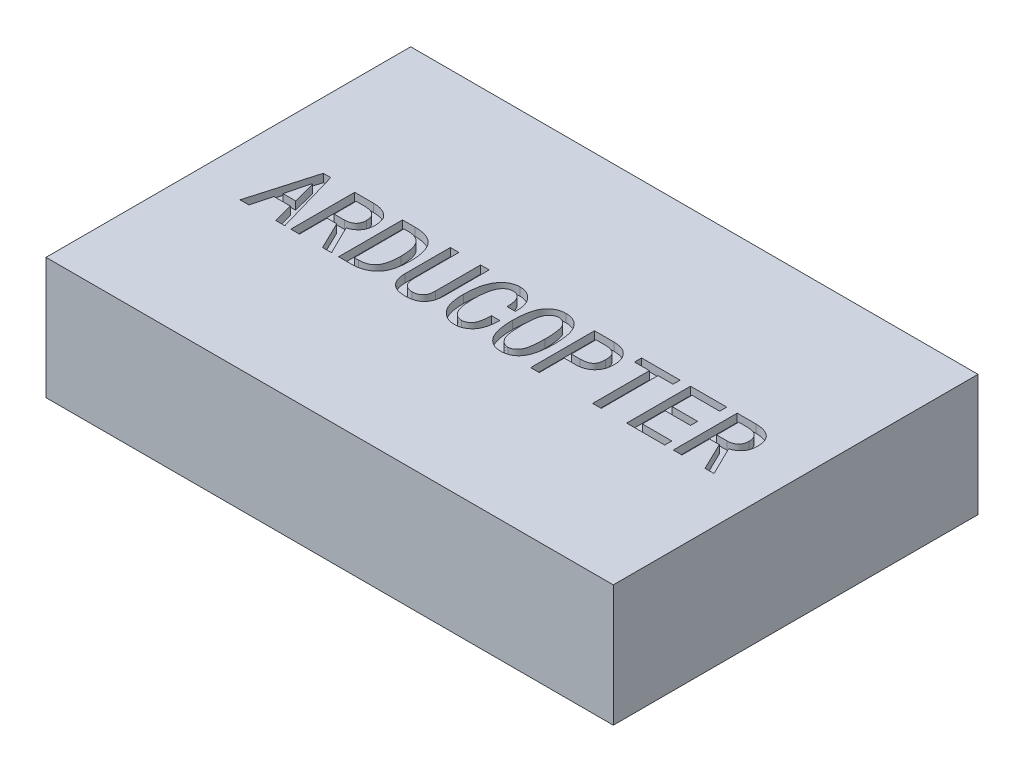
from build123d import *

# Parameters (mm, degrees)
SKETCH_1_W          = 70
SKETCH_1_H          = 45
EXTRUDE_1_DEPTH     = 15
CUT_EXTRUDE_1_DEPTH = 1


with BuildPart() as part:
    # Sketch 1 → Extrude 1 (new body)
    with BuildSketch(Plane(origin=(0, 0, 0), x_dir=(1, 0, 0), z_dir=(0, 1, 0))):
        Rectangle(SKETCH_1_W, SKETCH_1_H)
    extrude(amount=EXTRUDE_1_DEPTH)

    # Sketch 2 → Cut-Extrude 1 (cut)
    # profile 1 of 10: a face of its own
    with BuildSketch(Plane(origin=(0, 15, 0), x_dir=(1, 0, 0), z_dir=(0, 1, 0))):
        Polygon((-23.644846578, -4.387578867), (-24.751145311, -4.387578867), (-25.396486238, -1.944502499), (-27.424700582, -1.944502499), (-28.07004151, -4.387578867), (-29.176340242, -4.387578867), (-26.871551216, 3.586991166), (-25.949635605, 3.586991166), align=None)
        Polygon((-25.626965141, -1.068682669), (-26.36449763, 1.743159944), (-26.456689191, 1.743159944), (-27.194221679, -1.068682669), align=None, mode=Mode.SUBTRACT)
    # profile 2 of 10: a face of its own
    with BuildSketch(Plane(origin=(0, 15, 0), x_dir=(1, 0, 0), z_dir=(0, 1, 0))):
        with BuildLine():
            Line((-17.88287401, -4.387578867), (-18.989172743, -4.387578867))
            Line((-18.989172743, -4.387578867), (-20.648620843, -0.976491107))
            Line((-20.648620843, -0.976491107), (-21.847111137, -0.976491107))
            Line((-21.847111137, -0.976491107), (-21.847111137, -4.387578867))
            Line((-21.847111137, -4.387578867), (-22.907314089, -4.387578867))
            Line((-22.907314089, -4.387578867), (-22.907314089, 3.494799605))
            Line((-22.907314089, 3.494799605), (-20.602525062, 3.494799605))
            add(Edge.make_bspline(
                [(-20.602525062, 3.494799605), (-20.512567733, 3.493015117), (-20.336313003, 3.489518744), (-20.078159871, 3.466438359), (-19.833532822, 3.423223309), (-19.601934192, 3.364943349), (-19.382117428, 3.292886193), (-19.176814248, 3.199105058), (-18.982860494, 3.092073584), (-18.802713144, 2.967533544), (-18.639657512, 2.824467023), (-18.496904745, 2.6595892), (-18.378204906, 2.472695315), (-18.279465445, 2.265345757), (-18.205861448, 2.037102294), (-18.150603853, 1.788626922), (-18.118524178, 1.519214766), (-18.115111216, 1.332367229), (-18.113352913, 1.236106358)],
                knots=[0, 0, 0, 0, 1.124851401, 2.203938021, 3.236923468, 4.227547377, 5.188384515, 6.124748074, 7.04535131, 7.955333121, 8.85768773, 9.750678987, 10.67246398, 11.61778816, 12.61462837, 13.664292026, 14.796680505, 16, 16, 16, 16], degree=3))
            add(Edge.make_bspline(
                [(-18.113352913, 1.236106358), (-18.11443924, 1.161494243), (-18.116559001, 1.015902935), (-18.139515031, 0.8042374), (-18.17480282, 0.605508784), (-18.224171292, 0.419561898), (-18.288588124, 0.246426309), (-18.369887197, 0.08683872), (-18.463299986, -0.060922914), (-18.606568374, -0.236004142), (-18.804447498, -0.425502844), (-19.062793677, -0.613071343), (-19.339787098, -0.755222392), (-19.536611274, -0.810638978), (-19.634513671, -0.838203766)],
                knots=[0, 0, 0, 0, 0.960252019, 1.873748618, 2.737466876, 3.556786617, 4.347431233, 5.110891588, 5.858830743, 6.593445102, 8.018399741, 9.372640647, 10.693124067, 12, 12, 12, 12], degree=3))
            Line((-19.634513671, -0.838203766), (-17.88287401, -4.387578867))
        make_face()
        with BuildLine():
            add(Edge.make_bspline(
                [(-19.173555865, 1.236106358), (-19.175135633, 1.288493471), (-19.178217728, 1.390699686), (-19.194410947, 1.540139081), (-19.225867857, 1.680517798), (-19.267247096, 1.812981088), (-19.325765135, 1.934613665), (-19.390722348, 2.050445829), (-19.473265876, 2.154731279), (-19.564833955, 2.253107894), (-19.671507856, 2.340424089), (-19.792752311, 2.4167878), (-19.929786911, 2.479052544), (-20.081569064, 2.530046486), (-20.247643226, 2.571146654), (-20.429279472, 2.599461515), (-20.626088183, 2.616703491), (-20.762399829, 2.618203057), (-20.833003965, 2.618979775)],
                knots=[0, 0, 0, 0, 1.018423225, 1.986923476, 2.915383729, 3.810714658, 4.676600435, 5.533969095, 6.385612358, 7.253966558, 8.141821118, 9.056210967, 10.031005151, 11.059229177, 12.164336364, 13.351610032, 14.628236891, 16, 16, 16, 16], degree=3))
            Line((-20.833003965, 2.618979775), (-21.847111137, 2.618979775))
            Line((-21.847111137, 2.618979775), (-21.847111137, -0.100671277))
            Line((-21.847111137, -0.100671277), (-20.556429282, -0.100671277))
            add(Edge.make_bspline(
                [(-20.556429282, -0.100671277), (-20.466764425, -0.097274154), (-20.291266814, -0.090625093), (-20.037806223, -0.032287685), (-19.801148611, 0.060932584), (-19.619821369, 0.169578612), (-19.488610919, 0.277379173), (-19.404513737, 0.374987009), (-19.33195032, 0.484807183), (-19.274362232, 0.609484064), (-19.227913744, 0.746706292), (-19.196043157, 0.89797495), (-19.17756749, 1.062643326), (-19.174925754, 1.176872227), (-19.173555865, 1.236106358)],
                knots=[0, 0, 0, 0, 1.47184772, 2.880791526, 4.249240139, 5.638178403, 6.335067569, 7.030952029, 7.746845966, 8.491482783, 9.28109559, 10.123026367, 11.02668324, 12, 12, 12, 12], degree=3))
        make_face(mode=Mode.SUBTRACT)
    # profile 3 of 10: a face of its own
    with BuildSketch(Plane(origin=(0, 15, 0), x_dir=(1, 0, 0), z_dir=(0, 1, 0))):
        with BuildLine():
            add(Edge.make_bspline(
                [(-12.120901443, -0.469437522), (-12.123137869, -0.639698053), (-12.127453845, -0.968276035), (-12.171159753, -1.442181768), (-12.238847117, -1.878701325), (-12.337780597, -2.276974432), (-12.463493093, -2.637688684), (-12.616357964, -2.961477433), (-12.800012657, -3.246879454), (-13.013868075, -3.492182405), (-13.250730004, -3.703717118), (-13.506306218, -3.886856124), (-13.780141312, -4.043912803), (-14.075607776, -4.167845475), (-14.388408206, -4.26788342), (-14.722059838, -4.336568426), (-15.074395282, -4.380700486), (-15.316168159, -4.38525165), (-15.439797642, -4.387578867)],
                knots=[0, 0, 0, 0, 1.389524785, 2.681580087, 3.881416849, 4.992360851, 6.026729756, 6.995017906, 7.908603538, 8.787894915, 9.643211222, 10.495393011, 11.350494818, 12.214247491, 13.106065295, 14.027214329, 14.991224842, 16, 16, 16, 16], degree=3))
            Line((-15.439797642, -4.387578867), (-17.00705418, -4.387578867))
            Line((-17.00705418, -4.387578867), (-17.00705418, 3.494799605))
            Line((-17.00705418, 3.494799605), (-15.439797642, 3.494799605))
            add(Edge.make_bspline(
                [(-15.439797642, 3.494799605), (-15.301937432, 3.492703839), (-15.035118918, 3.488647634), (-14.649801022, 3.442643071), (-14.292232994, 3.372498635), (-13.962485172, 3.271736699), (-13.659878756, 3.142577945), (-13.38647735, 2.982170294), (-13.138987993, 2.795719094), (-12.921754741, 2.575239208), (-12.729686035, 2.322846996), (-12.565675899, 2.033033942), (-12.428740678, 1.706364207), (-12.313354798, 1.343904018), (-12.228685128, 0.942719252), (-12.166658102, 0.505252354), (-12.126087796, 0.030406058), (-12.122673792, -0.298624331), (-12.120901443, -0.469437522)],
                knots=[0, 0, 0, 0, 1.107739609, 2.143950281, 3.114742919, 4.033667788, 4.910720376, 5.753428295, 6.576026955, 7.394480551, 8.23354201, 9.118765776, 10.063698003, 11.076506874, 12.172173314, 13.355526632, 14.627145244, 16, 16, 16, 16], degree=3))
        make_face()
        with BuildLine():
            add(Edge.make_bspline(
                [(-13.227200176, -0.469437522), (-13.228777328, -0.332823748), (-13.231816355, -0.06958158), (-13.256614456, 0.310154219), (-13.301376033, 0.658226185), (-13.358819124, 0.975595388), (-13.437860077, 1.259639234), (-13.530388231, 1.513549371), (-13.643252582, 1.735492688), (-13.773950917, 1.927961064), (-13.923238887, 2.092253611), (-14.088970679, 2.234068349), (-14.272271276, 2.353406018), (-14.472620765, 2.452248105), (-14.690526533, 2.526080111), (-14.924758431, 2.58132598), (-15.176533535, 2.613844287), (-15.350355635, 2.617235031), (-15.439797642, 2.618979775)],
                knots=[0, 0, 0, 0, 1.50261862, 2.895407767, 4.182685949, 5.361245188, 6.439488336, 7.421939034, 8.328969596, 9.171036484, 9.973163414, 10.763455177, 11.563821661, 12.37285522, 13.214177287, 14.088724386, 15.01653284, 16, 16, 16, 16], degree=3))
            Line((-15.439797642, 2.618979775), (-15.946851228, 2.618979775))
            Line((-15.946851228, 2.618979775), (-15.946851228, -3.511759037))
            Line((-15.946851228, -3.511759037), (-15.439797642, -3.511759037))
            add(Edge.make_bspline(
                [(-15.439797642, -3.511759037), (-15.350371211, -3.509854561), (-15.176650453, -3.506154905), (-14.924860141, -3.475856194), (-14.690577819, -3.422331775), (-14.473090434, -3.349917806), (-14.272880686, -3.254683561), (-14.089187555, -3.140695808), (-13.923324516, -3.004033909), (-13.774650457, -2.845004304), (-13.642217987, -2.658710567), (-13.530581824, -2.440438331), (-13.437448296, -2.189595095), (-13.359102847, -1.908155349), (-13.301302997, -1.593724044), (-13.256422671, -1.247911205), (-13.231849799, -0.869290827), (-13.228788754, -0.606050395), (-13.227200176, -0.469437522)],
                knots=[0, 0, 0, 0, 0.9908866, 1.924907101, 2.80462885, 3.650254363, 4.45990781, 5.256111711, 6.040209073, 6.834462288, 7.662189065, 8.564851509, 9.54291023, 10.623211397, 11.798270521, 13.082748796, 14.486045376, 16, 16, 16, 16], degree=3))
        make_face(mode=Mode.SUBTRACT)
    # profile 4 of 10: a face of its own
    with BuildSketch(Plane(origin=(0, 15, 0), x_dir=(1, 0, 0), z_dir=(0, 1, 0))):
        with BuildLine():
            add(Edge.make_bspline(
                [(-6.312833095, -2.08278984), (-6.314269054, -2.172772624), (-6.31706628, -2.34805773), (-6.344693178, -2.603934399), (-6.39129586, -2.844470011), (-6.451698, -3.072701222), (-6.533741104, -3.285199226), (-6.633271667, -3.48401145), (-6.752001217, -3.667135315), (-6.886763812, -3.837031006), (-7.040369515, -3.991354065), (-7.219167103, -4.120841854), (-7.416389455, -4.232909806), (-7.635376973, -4.322517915), (-7.873946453, -4.395472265), (-8.134702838, -4.442589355), (-8.415370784, -4.474598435), (-8.609556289, -4.478009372), (-8.709813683, -4.479770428)],
                knots=[0, 0, 0, 0, 1.114057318, 2.17016686, 3.181914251, 4.146156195, 5.0898066, 5.997508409, 6.894781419, 7.787392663, 8.679419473, 9.581522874, 10.512482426, 11.482322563, 12.505662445, 13.596199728, 14.758925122, 16, 16, 16, 16], degree=3))
            add(Edge.make_bspline(
                [(-8.709813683, -4.479770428), (-8.810071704, -4.478011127), (-9.004258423, -4.474603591), (-9.28491788, -4.442570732), (-9.545703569, -4.39553573), (-9.784676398, -4.322146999), (-10.004474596, -4.233244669), (-10.202069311, -4.121429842), (-10.379422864, -3.990216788), (-10.534542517, -3.83764291), (-10.669510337, -3.667567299), (-10.786031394, -3.483469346), (-10.886184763, -3.285317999), (-10.967236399, -3.072354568), (-11.031172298, -2.845002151), (-11.074140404, -2.603661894), (-11.102779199, -2.348103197), (-11.105432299, -2.172788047), (-11.106794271, -2.08278984)],
                knots=[0, 0, 0, 0, 1.240869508, 2.403402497, 3.49375932, 4.516929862, 5.493116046, 6.423921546, 7.320215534, 8.217118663, 9.1095822, 10.00290763, 10.910459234, 11.853953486, 12.819913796, 13.830192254, 14.886127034, 16, 16, 16, 16], degree=3))
            Line((-11.106794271, -2.08278984), (-11.106794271, 3.494799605))
            Line((-11.106794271, 3.494799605), (-10.046591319, 3.494799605))
            Line((-10.046591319, 3.494799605), (-10.046591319, -2.08278984))
            add(Edge.make_bspline(
                [(-10.046591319, -2.08278984), (-10.046099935, -2.146035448), (-10.045150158, -2.268280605), (-10.023962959, -2.444699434), (-9.999484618, -2.609364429), (-9.956754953, -2.760110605), (-9.90746614, -2.899915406), (-9.841124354, -3.02395548), (-9.768005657, -3.138019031), (-9.679830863, -3.235999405), (-9.584872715, -3.323813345), (-9.479897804, -3.397365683), (-9.370230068, -3.46328131), (-9.250681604, -3.513449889), (-9.126191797, -3.556071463), (-8.993317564, -3.581118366), (-8.854464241, -3.602394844), (-8.758848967, -3.603423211), (-8.709813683, -3.603950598)],
                knots=[0, 0, 0, 0, 1.315659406, 2.542990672, 3.696132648, 4.776878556, 5.800314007, 6.775421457, 7.698841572, 8.613938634, 9.511376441, 10.385998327, 11.278101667, 12.169575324, 13.080058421, 14.011877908, 14.98041258, 16, 16, 16, 16], degree=3))
            add(Edge.make_bspline(
                [(-8.709813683, -3.603950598), (-8.660778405, -3.603423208), (-8.565163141, -3.602394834), (-8.426309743, -3.581118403), (-8.293435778, -3.556071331), (-8.168945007, -3.513450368), (-8.049400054, -3.463279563), (-7.939719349, -3.397372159), (-7.83479235, -3.32378944), (-7.739650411, -3.23609204), (-7.651969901, -3.137427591), (-7.576156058, -3.024998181), (-7.512759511, -2.899312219), (-7.462513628, -2.760239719), (-7.420872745, -2.609130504), (-7.392748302, -2.445030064), (-7.375286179, -2.268125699), (-7.3738035, -2.146002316), (-7.373036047, -2.08278984)],
                knots=[0, 0, 0, 0, 1.019461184, 1.987875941, 2.91958006, 3.82995043, 4.721313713, 5.613306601, 6.4878202, 7.385146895, 8.300130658, 9.230025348, 10.199598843, 11.222907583, 12.303519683, 13.45852564, 14.684503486, 16, 16, 16, 16], degree=3))
            Line((-7.373036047, -2.08278984), (-7.373036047, 3.494799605))
            Line((-7.373036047, 3.494799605), (-6.312833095, 3.494799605))
            Line((-6.312833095, 3.494799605), (-6.312833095, -2.08278984))
        make_face()
    # profile 5 of 10: a face of its own
    with BuildSketch(Plane(origin=(0, 15, 0), x_dir=(1, 0, 0), z_dir=(0, 1, 0))):
        with BuildLine():
            add(Edge.make_bspline(
                [(-0.228190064, -1.253065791), (-0.234100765, -1.393724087), (-0.245513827, -1.665323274), (-0.286077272, -2.056556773), (-0.346548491, -2.416147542), (-0.428000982, -2.74409904), (-0.529940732, -3.041069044), (-0.652167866, -3.307375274), (-0.795731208, -3.541616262), (-0.959674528, -3.743459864), (-1.139098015, -3.915190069), (-1.324807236, -4.067132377), (-1.520783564, -4.193236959), (-1.723777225, -4.300108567), (-1.937758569, -4.378957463), (-2.159320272, -4.438108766), (-2.389626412, -4.47263395), (-2.545955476, -4.477370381), (-2.625170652, -4.479770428)],
                knots=[0, 0, 0, 0, 1.494742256, 2.886219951, 4.173809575, 5.363956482, 6.470526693, 7.503352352, 8.469361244, 9.380145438, 10.256246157, 11.102836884, 11.924181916, 12.726930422, 13.533966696, 14.340165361, 15.1589274, 16, 16, 16, 16], degree=3))
            add(Edge.make_bspline(
                [(-2.625170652, -4.479770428), (-2.715838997, -4.47739236), (-2.894799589, -4.472698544), (-3.157479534, -4.427965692), (-3.410944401, -4.358397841), (-3.653183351, -4.258389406), (-3.887027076, -4.132804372), (-4.108699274, -3.976743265), (-4.31927983, -3.791556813), (-4.522483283, -3.582244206), (-4.707629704, -3.339546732), (-4.866487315, -3.061196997), (-5.002040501, -2.749980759), (-5.109089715, -2.404253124), (-5.194814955, -2.025827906), (-5.254563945, -1.613701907), (-5.292960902, -1.167863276), (-5.296761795, -0.859344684), (-5.298725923, -0.699916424)],
                knots=[0, 0, 0, 0, 0.834912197, 1.647944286, 2.448293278, 3.25272125, 4.057593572, 4.889800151, 5.744779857, 6.638682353, 7.574302, 8.549391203, 9.585101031, 10.696366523, 11.879553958, 13.157474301, 14.531113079, 16, 16, 16, 16], degree=3))
            add(Edge.make_bspline(
                [(-5.298725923, -0.699916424), (-5.296571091, -0.525145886), (-5.292396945, -0.186596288), (-5.256427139, 0.304201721), (-5.197081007, 0.760179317), (-5.117068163, 1.18248041), (-5.00885388, 1.569133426), (-4.880703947, 1.92349729), (-4.725193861, 2.242044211), (-4.546874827, 2.526437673), (-4.348418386, 2.774667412), (-4.13826255, 2.993434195), (-3.910579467, 3.174391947), (-3.672383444, 3.327762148), (-3.418038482, 3.444007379), (-3.1500285, 3.526431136), (-2.868944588, 3.577134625), (-2.676599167, 3.583675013), (-2.579074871, 3.586991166)],
                knots=[0, 0, 0, 0, 1.47527999, 2.857778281, 4.151479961, 5.355606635, 6.48275776, 7.537632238, 8.53243139, 9.469452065, 10.365307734, 11.211246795, 12.024566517, 12.814930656, 13.597414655, 14.376958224, 15.177074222, 16, 16, 16, 16], degree=3))
            add(Edge.make_bspline(
                [(-2.579074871, 3.586991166), (-2.496426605, 3.584770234), (-2.33374412, 3.580398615), (-2.095021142, 3.543573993), (-1.867439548, 3.483703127), (-1.649668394, 3.401785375), (-1.443984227, 3.292926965), (-1.249026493, 3.161001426), (-1.064477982, 3.005682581), (-0.893175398, 2.827319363), (-0.737728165, 2.62735104), (-0.601277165, 2.40790993), (-0.491003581, 2.167036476), (-0.401760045, 1.907440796), (-0.335822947, 1.628291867), (-0.292092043, 1.330169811), (-0.269405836, 1.012802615), (-0.272626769, 0.795095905), (-0.274285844, 0.682956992)],
                knots=[0, 0, 0, 0, 0.945956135, 1.861993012, 2.758160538, 3.636767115, 4.519928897, 5.416356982, 6.327443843, 7.276805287, 8.242661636, 9.222809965, 10.22861537, 11.269278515, 12.361406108, 13.507821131, 14.716299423, 16, 16, 16, 16], degree=3))
            Line((-0.274285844, 0.682956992), (-1.288393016, 0.682956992))
            add(Edge.make_bspline(
                [(-1.288393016, 0.682956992), (-1.289313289, 0.764927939), (-1.291091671, 0.923332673), (-1.306516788, 1.153579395), (-1.332358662, 1.367674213), (-1.36458999, 1.566755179), (-1.412435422, 1.748606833), (-1.464750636, 1.916578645), (-1.532617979, 2.06721471), (-1.607265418, 2.203485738), (-1.692494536, 2.323920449), (-1.789213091, 2.427581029), (-1.895942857, 2.515448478), (-2.012701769, 2.588139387), (-2.140767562, 2.642766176), (-2.277893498, 2.681689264), (-2.425112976, 2.706399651), (-2.526617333, 2.709545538), (-2.579074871, 2.711171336)],
                knots=[0, 0, 0, 0, 1.447060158, 2.796371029, 4.07121282, 5.253842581, 6.352813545, 7.388565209, 8.355623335, 9.26412738, 10.128389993, 10.952966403, 11.759535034, 12.562529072, 13.372531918, 14.208837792, 15.074325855, 16, 16, 16, 16], degree=3))
            add(Edge.make_bspline(
                [(-2.579074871, 2.711171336), (-2.639005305, 2.708935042), (-2.757128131, 2.704527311), (-2.929320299, 2.667776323), (-3.091502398, 2.606882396), (-3.245837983, 2.524373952), (-3.389615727, 2.415478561), (-3.522997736, 2.282721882), (-3.646960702, 2.126754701), (-3.761840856, 1.946521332), (-3.864683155, 1.737824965), (-3.953234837, 1.498051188), (-4.027170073, 1.225943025), (-4.087926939, 0.921276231), (-4.134886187, 0.584910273), (-4.168453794, 0.216304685), (-4.188876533, -0.184663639), (-4.191213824, -0.463152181), (-4.19242719, -0.607724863)],
                knots=[0, 0, 0, 0, 0.702271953, 1.384177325, 2.053558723, 2.728373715, 3.429090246, 4.160530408, 4.929691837, 5.760909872, 6.662226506, 7.652627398, 8.753591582, 9.965523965, 11.293414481, 12.734409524, 14.304723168, 16, 16, 16, 16], degree=3))
            add(Edge.make_bspline(
                [(-4.19242719, -0.607724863), (-4.191214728, -0.740917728), (-4.188881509, -0.997229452), (-4.168506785, -1.365797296), (-4.134869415, -1.703699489), (-4.088219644, -2.010604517), (-4.026960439, -2.287366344), (-3.953236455, -2.533479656), (-3.864934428, -2.749105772), (-3.761634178, -2.934479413), (-3.645965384, -3.09194572), (-3.524311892, -3.228939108), (-3.393938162, -3.343823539), (-3.256296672, -3.439368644), (-3.109778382, -3.513425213), (-2.955426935, -3.566761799), (-2.792624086, -3.598287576), (-2.68164782, -3.602040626), (-2.625170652, -3.603950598)],
                knots=[0, 0, 0, 0, 1.695965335, 3.263656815, 4.698586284, 6.018671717, 7.214194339, 8.305339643, 9.286425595, 10.175404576, 11.000155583, 11.769871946, 12.504076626, 13.207599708, 13.897898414, 14.587702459, 15.281264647, 16, 16, 16, 16], degree=3))
            add(Edge.make_bspline(
                [(-2.625170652, -3.603950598), (-2.583498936, -3.602932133), (-2.500019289, -3.600891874), (-2.377040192, -3.575098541), (-2.25606242, -3.537596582), (-2.138106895, -3.484933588), (-2.025050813, -3.414604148), (-1.912502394, -3.333188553), (-1.806398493, -3.232199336), (-1.697868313, -3.120368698), (-1.598616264, -2.983381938), (-1.516629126, -2.817079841), (-1.444417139, -2.624518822), (-1.388510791, -2.403794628), (-1.341784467, -2.15589223), (-1.310759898, -1.879723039), (-1.292338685, -1.575421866), (-1.289744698, -1.363496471), (-1.288393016, -1.253065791)],
                knots=[0, 0, 0, 0, 0.660928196, 1.324016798, 1.987351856, 2.671191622, 3.368874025, 4.099346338, 4.873489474, 5.6921189, 6.572789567, 7.547167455, 8.628526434, 9.834544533, 11.159025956, 12.633584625, 14.245818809, 16, 16, 16, 16], degree=3))
            Line((-1.288393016, -1.253065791), (-0.228190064, -1.253065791))
        make_face()
    # profile 6 of 10: a face of its own
    with BuildSketch(Plane(origin=(0, 15, 0), x_dir=(1, 0, 0), z_dir=(0, 1, 0))):
        with BuildLine():
            add(Edge.make_bspline(
                [(5.625974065, -0.423341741), (5.624101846, -0.597524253), (5.62048886, -0.933659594), (5.590369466, -1.418685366), (5.537896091, -1.86555094), (5.465460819, -2.274635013), (5.372615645, -2.645946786), (5.259145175, -2.979859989), (5.122797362, -3.275484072), (4.964961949, -3.534401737), (4.787547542, -3.757833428), (4.59504144, -3.951608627), (4.385146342, -4.115190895), (4.158728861, -4.249381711), (3.915095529, -4.352602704), (3.655277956, -4.425735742), (3.378539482, -4.471158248), (3.188197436, -4.476853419), (3.090706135, -4.479770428)],
                knots=[0, 0, 0, 0, 1.545836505, 2.983136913, 4.310657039, 5.537175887, 6.667851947, 7.704493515, 8.662599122, 9.55136463, 10.389079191, 11.189082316, 11.970061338, 12.744463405, 13.518420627, 14.311409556, 15.135120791, 16, 16, 16, 16], degree=3))
            add(Edge.make_bspline(
                [(3.090706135, -4.479770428), (2.993210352, -4.476875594), (2.802859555, -4.471223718), (2.525099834, -4.425313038), (2.263027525, -4.352548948), (2.016186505, -4.249962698), (1.787367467, -4.114236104), (1.572777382, -3.951901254), (1.375157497, -3.758031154), (1.192712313, -3.53463177), (1.029206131, -3.276233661), (0.890293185, -2.97963948), (0.770647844, -2.64652322), (0.674652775, -2.274894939), (0.600843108, -1.865596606), (0.546665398, -1.418740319), (0.514348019, -0.933721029), (0.511050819, -0.597532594), (0.509342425, -0.423341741)],
                knots=[0, 0, 0, 0, 0.860715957, 1.680462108, 2.47930714, 3.258798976, 4.033804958, 4.822976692, 5.629862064, 6.472991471, 7.365455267, 8.323231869, 9.359903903, 10.487649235, 11.709164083, 13.030896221, 14.461604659, 16, 16, 16, 16], degree=3))
            add(Edge.make_bspline(
                [(0.509342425, -0.423341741), (0.51104176, -0.249151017), (0.514315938, 0.086469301), (0.54663203, 0.570360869), (0.60092551, 1.015486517), (0.67414424, 1.422092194), (0.770899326, 1.790167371), (0.890410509, 2.119274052), (1.028216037, 2.412096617), (1.193370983, 2.664400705), (1.375085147, 2.882672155), (1.573468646, 3.071129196), (1.787372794, 3.230305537), (2.016775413, 3.362021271), (2.263044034, 3.46345332), (2.525390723, 3.53365599), (2.802773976, 3.580714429), (2.993190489, 3.584865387), (3.090706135, 3.586991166)],
                knots=[0, 0, 0, 0, 1.548230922, 2.98303917, 4.308200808, 5.532550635, 6.652834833, 7.686623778, 8.641401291, 9.522543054, 10.35935634, 11.160886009, 11.949022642, 12.72391454, 13.50644669, 14.309045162, 15.13403228, 16, 16, 16, 16], degree=3))
            add(Edge.make_bspline(
                [(3.090706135, 3.586991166), (3.188217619, 3.584843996), (3.378626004, 3.580651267), (3.654982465, 3.534074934), (3.915076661, 3.46350528), (4.158146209, 3.361451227), (4.385120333, 3.231250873), (4.594355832, 3.070857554), (4.787624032, 2.882471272), (4.964316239, 2.664187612), (5.123787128, 2.411315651), (5.259026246, 2.11949971), (5.372378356, 1.78959076), (5.465956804, 1.421823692), (5.537816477, 1.015441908), (5.59040152, 0.570305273), (5.620519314, 0.086407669), (5.624110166, -0.249159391), (5.625974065, -0.423341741)],
                knots=[0, 0, 0, 0, 0.870222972, 1.699263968, 2.496006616, 3.272995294, 4.047285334, 4.827112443, 5.621581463, 6.452817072, 7.330064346, 8.285160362, 9.318904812, 10.442120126, 11.67157227, 13.002634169, 14.444161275, 16, 16, 16, 16], degree=3))
        make_face()
        with BuildLine():
            add(Edge.make_bspline(
                [(4.519675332, -0.423341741), (4.518320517, -0.26910071), (4.515729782, 0.025845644), (4.497570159, 0.44728907), (4.466191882, 0.82737073), (4.420282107, 1.16579776), (4.364384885, 1.463582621), (4.293171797, 1.718983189), (4.211576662, 1.934121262), (4.112221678, 2.108533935), (4.0025656, 2.251136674), (3.891054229, 2.374555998), (3.772116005, 2.478784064), (3.646391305, 2.562330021), (3.516668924, 2.63078305), (3.379246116, 2.6761738), (3.237229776, 2.707325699), (3.139817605, 2.709882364), (3.090706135, 2.711171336)],
                knots=[0, 0, 0, 0, 1.935009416, 3.700208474, 5.290966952, 6.717666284, 7.983429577, 9.088666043, 10.040575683, 10.86236036, 11.596304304, 12.29363804, 12.946461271, 13.574167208, 14.184039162, 14.780089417, 15.384968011, 16, 16, 16, 16], degree=3))
            add(Edge.make_bspline(
                [(3.090706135, 2.711171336), (3.041599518, 2.709848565), (2.943638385, 2.707209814), (2.800491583, 2.676165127), (2.661355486, 2.630846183), (2.529576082, 2.562004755), (2.400742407, 2.478373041), (2.276618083, 2.375462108), (2.162055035, 2.250125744), (2.044890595, 2.109655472), (1.940911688, 1.934407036), (1.853411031, 1.71965487), (1.779555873, 1.463678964), (1.719502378, 1.166093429), (1.672615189, 0.827386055), (1.639405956, 0.447339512), (1.61910706, 0.025887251), (1.616831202, -0.269095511), (1.615641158, -0.423341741)],
                knots=[0, 0, 0, 0, 0.611089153, 1.219041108, 1.817987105, 2.430269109, 3.065779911, 3.730623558, 4.433151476, 5.17984647, 6.00710797, 6.960941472, 8.063026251, 9.323472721, 10.742001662, 12.323182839, 14.077395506, 16, 16, 16, 16], degree=3))
            add(Edge.make_bspline(
                [(1.615641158, -0.423341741), (1.616843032, -0.577587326), (1.619145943, -0.873137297), (1.639378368, -1.295731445), (1.67278022, -1.678027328), (1.719343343, -2.019042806), (1.779691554, -2.319434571), (1.854215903, -2.579034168), (1.940508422, -2.799301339), (2.045048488, -2.9798601), (2.161426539, -3.125690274), (2.277186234, -3.254304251), (2.400112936, -3.362473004), (2.529096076, -3.449739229), (2.661322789, -3.519922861), (2.800151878, -3.567787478), (2.943741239, -3.597716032), (3.04162179, -3.601868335), (3.090706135, -3.603950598)],
                knots=[0, 0, 0, 0, 1.904974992, 3.650122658, 5.223805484, 6.643247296, 7.899019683, 9.004487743, 9.975563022, 10.813390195, 11.569780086, 12.276151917, 12.948593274, 13.586073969, 14.195949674, 14.79168842, 15.394065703, 16, 16, 16, 16], degree=3))
            add(Edge.make_bspline(
                [(3.090706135, -3.603950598), (3.139794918, -3.601900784), (3.237126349, -3.597836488), (3.379589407, -3.567791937), (3.516700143, -3.519858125), (3.64688568, -3.450063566), (3.772765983, -3.362863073), (3.890452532, -3.253419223), (4.003220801, -3.126668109), (4.11202989, -2.978756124), (4.211964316, -2.799008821), (4.29238914, -2.578400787), (4.364255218, -2.319338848), (4.420433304, -2.018747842), (4.466032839, -1.678013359), (4.497597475, -1.295681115), (4.515693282, -0.873095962), (4.518309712, -0.577582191), (4.519675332, -0.423341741)],
                knots=[0, 0, 0, 0, 0.609746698, 1.208983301, 1.801799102, 2.40924424, 3.039088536, 3.699939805, 4.401261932, 5.145395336, 5.978015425, 6.947413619, 8.055962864, 9.316862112, 10.744271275, 12.327239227, 14.08303934, 16, 16, 16, 16], degree=3))
        make_face(mode=Mode.SUBTRACT)
    # profile 7 of 10: a face of its own
    with BuildSketch(Plane(origin=(0, 15, 0), x_dir=(1, 0, 0), z_dir=(0, 1, 0))):
        with BuildLine():
            add(Edge.make_bspline(
                [(11.526233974, 1.097819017), (11.524431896, 1.007801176), (11.520919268, 0.832337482), (11.488802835, 0.576634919), (11.440566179, 0.335149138), (11.370088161, 0.107265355), (11.278316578, -0.105593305), (11.165937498, -0.303642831), (11.035820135, -0.488580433), (10.883411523, -0.656300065), (10.715274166, -0.809842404), (10.527052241, -0.938632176), (10.326204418, -1.051737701), (10.107351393, -1.141396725), (9.873896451, -1.213757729), (9.623642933, -1.261909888), (9.358851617, -1.293812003), (9.176586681, -1.297348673), (9.083157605, -1.299161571)],
                knots=[0, 0, 0, 0, 1.113585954, 2.170613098, 3.184453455, 4.157933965, 5.11693774, 6.047298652, 6.971642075, 7.9092259, 8.846809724, 9.782672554, 10.725321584, 11.694538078, 12.703744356, 13.745194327, 14.844185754, 16, 16, 16, 16], degree=3))
            Line((9.083157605, -1.299161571), (7.74637997, -1.299161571))
            Line((7.74637997, -1.299161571), (7.74637997, -4.387578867))
            Line((7.74637997, -4.387578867), (6.686177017, -4.387578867))
            Line((6.686177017, -4.387578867), (6.686177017, 3.494799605))
            Line((6.686177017, 3.494799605), (9.083157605, 3.494799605))
            add(Edge.make_bspline(
                [(9.083157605, 3.494799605), (9.176580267, 3.492967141), (9.358832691, 3.489392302), (9.623712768, 3.457760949), (9.873490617, 3.408683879), (10.108114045, 3.339713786), (10.325749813, 3.246824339), (10.527121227, 3.13444348), (10.715254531, 3.005433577), (10.883421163, 2.851952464), (11.035801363, 2.684208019), (11.166002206, 2.499308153), (11.277813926, 2.301585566), (11.370863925, 2.089235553), (11.440187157, 1.860930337), (11.48887989, 1.619029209), (11.520898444, 1.3632935), (11.524424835, 1.187834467), (11.526233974, 1.097819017)],
                knots=[0, 0, 0, 0, 1.155744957, 2.254670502, 3.296058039, 4.30316213, 5.275054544, 6.217647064, 7.153453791, 8.090981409, 9.028509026, 9.952797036, 10.883102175, 11.835587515, 12.815737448, 13.829517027, 14.886480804, 16, 16, 16, 16], degree=3))
        make_face()
        with BuildLine():
            add(Edge.make_bspline(
                [(10.466031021, 1.097819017), (10.464668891, 1.167858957), (10.462050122, 1.302514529), (10.443647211, 1.496097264), (10.411980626, 1.672909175), (10.365569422, 1.832257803), (10.308919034, 1.975528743), (10.235466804, 2.099749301), (10.152675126, 2.209265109), (10.052541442, 2.299486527), (9.93947359, 2.373949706), (9.81686614, 2.441624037), (9.679330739, 2.495659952), (9.530087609, 2.542178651), (9.366816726, 2.574855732), (9.191982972, 2.601012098), (9.003753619, 2.616237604), (8.873761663, 2.61804548), (8.806582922, 2.618979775)],
                knots=[0, 0, 0, 0, 1.283231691, 2.467082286, 3.559210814, 4.568987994, 5.504250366, 6.37341159, 7.205635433, 8.010158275, 8.828615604, 9.682442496, 10.571210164, 11.531028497, 12.54333288, 13.618353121, 14.769185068, 16, 16, 16, 16], degree=3))
            Line((8.806582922, 2.618979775), (7.74637997, 2.618979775))
            Line((7.74637997, 2.618979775), (7.74637997, -0.423341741))
            Line((7.74637997, -0.423341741), (8.806582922, -0.423341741))
            add(Edge.make_bspline(
                [(8.806582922, -0.423341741), (8.873761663, -0.422407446), (9.003753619, -0.42059957), (9.191982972, -0.405374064), (9.366816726, -0.379217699), (9.530087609, -0.346540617), (9.679330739, -0.300021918), (9.81686614, -0.245986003), (9.93947359, -0.178311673), (10.052541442, -0.103848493), (10.152675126, -0.013627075), (10.235466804, 0.095888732), (10.308919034, 0.220109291), (10.365569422, 0.363380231), (10.411980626, 0.522728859), (10.443647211, 0.699540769), (10.462050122, 0.893123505), (10.464668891, 1.027779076), (10.466031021, 1.097819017)],
                knots=[0, 0, 0, 0, 1.230814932, 2.381646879, 3.45666712, 4.468971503, 5.428789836, 6.317557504, 7.171384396, 7.989841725, 8.794364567, 9.62658841, 10.495749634, 11.431012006, 12.440789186, 13.532917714, 14.716768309, 16, 16, 16, 16], degree=3))
        make_face(mode=Mode.SUBTRACT)
    # profile 8 of 10: a face of its own
    with BuildSketch(Plane(origin=(0, 15, 0), x_dir=(1, 0, 0), z_dir=(0, 1, 0))):
        Polygon((17.242110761, 2.618979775), (15.398279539, 2.618979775), (15.398279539, -4.387578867), (14.338076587, -4.387578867), (14.338076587, 2.618979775), (12.494245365, 2.618979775), (12.494245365, 3.494799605), (17.242110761, 3.494799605), align=None)
    # profile 9 of 10: a face of its own
    with BuildSketch(Plane(origin=(0, 15, 0), x_dir=(1, 0, 0), z_dir=(0, 1, 0))):
        Polygon((23.234562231, -4.387578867), (18.532792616, -4.387578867), (18.532792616, 3.494799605), (23.004083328, 3.494799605), (23.004083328, 2.618979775), (19.592995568, 2.618979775), (19.592995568, 0.175903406), (22.727508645, 0.175903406), (22.727508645, -0.699916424), (19.592995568, -0.699916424), (19.592995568, -3.511759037), (23.234562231, -3.511759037), align=None)
    # profile 10 of 10: a face of its own
    with BuildSketch(Plane(origin=(0, 15, 0), x_dir=(1, 0, 0), z_dir=(0, 1, 0))):
        with BuildLine():
            Line((29.319205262, -4.387578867), (28.212906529, -4.387578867))
            Line((28.212906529, -4.387578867), (26.55345843, -0.976491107))
            Line((26.55345843, -0.976491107), (25.354968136, -0.976491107))
            Line((25.354968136, -0.976491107), (25.354968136, -4.387578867))
            Line((25.354968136, -4.387578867), (24.294765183, -4.387578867))
            Line((24.294765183, -4.387578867), (24.294765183, 3.494799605))
            Line((24.294765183, 3.494799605), (26.59955421, 3.494799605))
            add(Edge.make_bspline(
                [(26.59955421, 3.494799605), (26.68951154, 3.493015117), (26.865766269, 3.489518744), (27.123919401, 3.466438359), (27.36854645, 3.423223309), (27.600145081, 3.364943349), (27.819961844, 3.292886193), (28.025265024, 3.199105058), (28.219218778, 3.092073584), (28.399366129, 2.967533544), (28.56242176, 2.824467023), (28.705174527, 2.6595892), (28.823874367, 2.472695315), (28.922613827, 2.265345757), (28.996217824, 2.037102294), (29.051475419, 1.788626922), (29.083555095, 1.519214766), (29.086968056, 1.332367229), (29.088726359, 1.236106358)],
                knots=[0, 0, 0, 0, 1.124851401, 2.203938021, 3.236923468, 4.227547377, 5.188384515, 6.124748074, 7.04535131, 7.955333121, 8.85768773, 9.750678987, 10.67246398, 11.61778816, 12.61462837, 13.664292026, 14.796680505, 16, 16, 16, 16], degree=3))
            add(Edge.make_bspline(
                [(29.088726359, 1.236106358), (29.087640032, 1.161494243), (29.085520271, 1.015902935), (29.062564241, 0.8042374), (29.027276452, 0.605508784), (28.97790798, 0.419561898), (28.913491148, 0.246426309), (28.832192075, 0.08683872), (28.738779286, -0.060922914), (28.595510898, -0.236004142), (28.397631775, -0.425502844), (28.139285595, -0.613071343), (27.862292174, -0.755222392), (27.665467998, -0.810638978), (27.567565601, -0.838203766)],
                knots=[0, 0, 0, 0, 0.960252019, 1.873748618, 2.737466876, 3.556786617, 4.347431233, 5.110891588, 5.858830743, 6.593445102, 8.018399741, 9.372640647, 10.693124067, 12, 12, 12, 12], degree=3))
            Line((27.567565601, -0.838203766), (29.319205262, -4.387578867))
        make_face()
        with BuildLine():
            add(Edge.make_bspline(
                [(28.028523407, 1.236106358), (28.026943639, 1.288493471), (28.023861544, 1.390699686), (28.007668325, 1.540139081), (27.976211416, 1.680517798), (27.934832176, 1.812981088), (27.876314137, 1.934613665), (27.811356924, 2.050445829), (27.728813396, 2.154731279), (27.637245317, 2.253107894), (27.530571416, 2.340424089), (27.409326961, 2.4167878), (27.272292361, 2.479052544), (27.120510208, 2.530046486), (26.954436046, 2.571146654), (26.7727998, 2.599461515), (26.575991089, 2.616703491), (26.439679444, 2.618203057), (26.369075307, 2.618979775)],
                knots=[0, 0, 0, 0, 1.018423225, 1.986923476, 2.915383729, 3.810714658, 4.676600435, 5.533969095, 6.385612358, 7.253966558, 8.141821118, 9.056210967, 10.031005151, 11.059229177, 12.164336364, 13.351610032, 14.628236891, 16, 16, 16, 16], degree=3))
            Line((26.369075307, 2.618979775), (25.354968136, 2.618979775))
            Line((25.354968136, 2.618979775), (25.354968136, -0.100671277))
            Line((25.354968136, -0.100671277), (26.645649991, -0.100671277))
            add(Edge.make_bspline(
                [(26.645649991, -0.100671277), (26.735314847, -0.097274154), (26.910812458, -0.090625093), (27.16427305, -0.032287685), (27.400930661, 0.060932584), (27.582257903, 0.169578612), (27.713468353, 0.277379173), (27.797565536, 0.374987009), (27.870128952, 0.484807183), (27.92771704, 0.609484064), (27.974165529, 0.746706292), (28.006036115, 0.89797495), (28.024511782, 1.062643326), (28.027153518, 1.176872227), (28.028523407, 1.236106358)],
                knots=[0, 0, 0, 0, 1.47184772, 2.880791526, 4.249240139, 5.638178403, 6.335067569, 7.030952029, 7.746845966, 8.491482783, 9.28109559, 10.123026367, 11.02668324, 12, 12, 12, 12], degree=3))
        make_face(mode=Mode.SUBTRACT)
    extrude(amount=-CUT_EXTRUDE_1_DEPTH, mode=Mode.SUBTRACT)


solid = part.part
